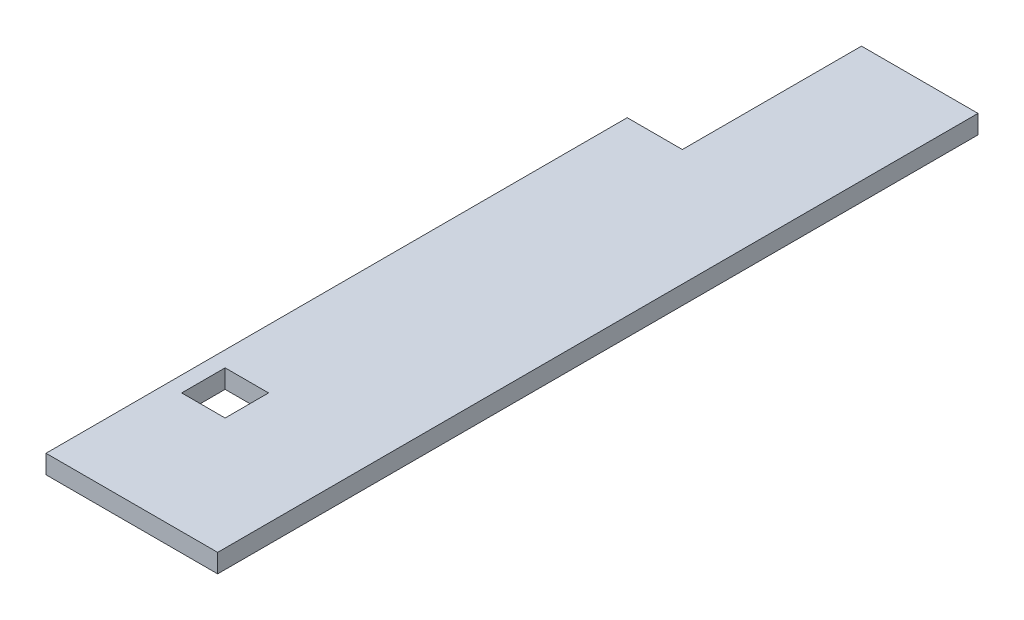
from build123d import *

# Parameters (mm, degrees)
SKETCH1_W           = 1168.4
SKETCH1_H           = 3956.14144
BOSS_EXTRUDE1_DEPTH = 127
SKETCH2_W           = 793.0642
SKETCH2_H           = 1219.2
BOSS_EXTRUDE2_DEPTH = 127
SKETCH3_W           = 295.7576
SKETCH3_H           = 295.7576
CUT_EXTRUDE1_DEPTH  = 3253.684844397


with BuildPart() as part:
    # Sketch1 → Boss-Extrude1 (new body)
    with BuildSketch(Plane(origin=(0, 0, 0), x_dir=(1, 0, 0), z_dir=(0, 1, 0))):
        Rectangle(SKETCH1_W, SKETCH1_H)
    extrude(amount=BOSS_EXTRUDE1_DEPTH)

    # Sketch2 → Boss-Extrude2 (add)
    with BuildSketch(Plane(origin=(0, 0, 0), x_dir=(1, 0, 0), z_dir=(0, 1, 0))):
        with Locations((187.6679, 2587.67072)):
            Rectangle(SKETCH2_W, SKETCH2_H)
    extrude(amount=BOSS_EXTRUDE2_DEPTH)

    # Sketch3 → Cut-Extrude1 (cut, through all)
    with BuildSketch(Plane(origin=(0, 127, 0), x_dir=(1, 0, 0), z_dir=(0, 1, 0))):
        with Locations((-330.2, -1012.87072)):
            Rectangle(SKETCH3_W, SKETCH3_H)
    extrude(amount=-CUT_EXTRUDE1_DEPTH, mode=Mode.SUBTRACT)


solid = part.part
